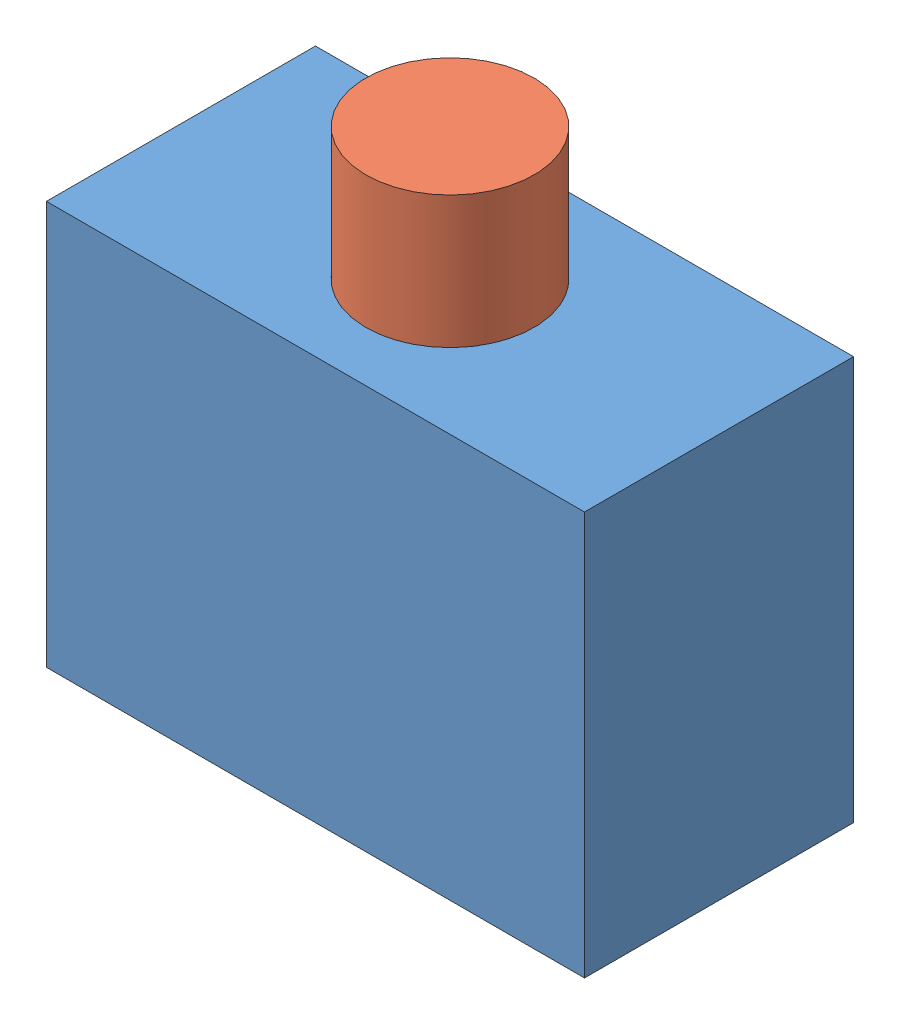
SolidWorks assembly PRECISION.SLDASM, configuration Most Material (file format 4400). Lengths in mm.
Overall size (50.8 50.57 25.4).
2 component instances, 2 part files, 2 mates.
Components (placement in the parent):
- TOLERANCE-Block-1: TOLERANCE-Block.SLDPRT [HOLE MINIMUM 0-625] at origin size (50.8 38.1 25.4)
- TOLERANCE-Pin-1: TOLERANCE-Pin.SLDPRT [MAXIMUM 0-625] at (0 -6.5764 0) x (-0.953109 0 0.302626) z (-0.302626 0 -0.953109) size (15.88 38.1 15.88)
Mates (geometry in assembly coordinates):
- Concentric1: concentric anti-aligned: cylinder of TOLERANCE-Block-1 through (0 -19.05 0) axis (0 1 0) radius 7.9375; cylinder of TOLERANCE-Pin-1 through (0 31.5236 0) axis (0 -1 0) radius 7.9375
- Coincident1: coincident aligned: plane of TOLERANCE-Block-1 through (-44.3184 19.05 0) normal (0 1 0); plane of TOLERANCE-Pin-1 through (15.5982 19.05 8.1605) normal (0 1 0)
